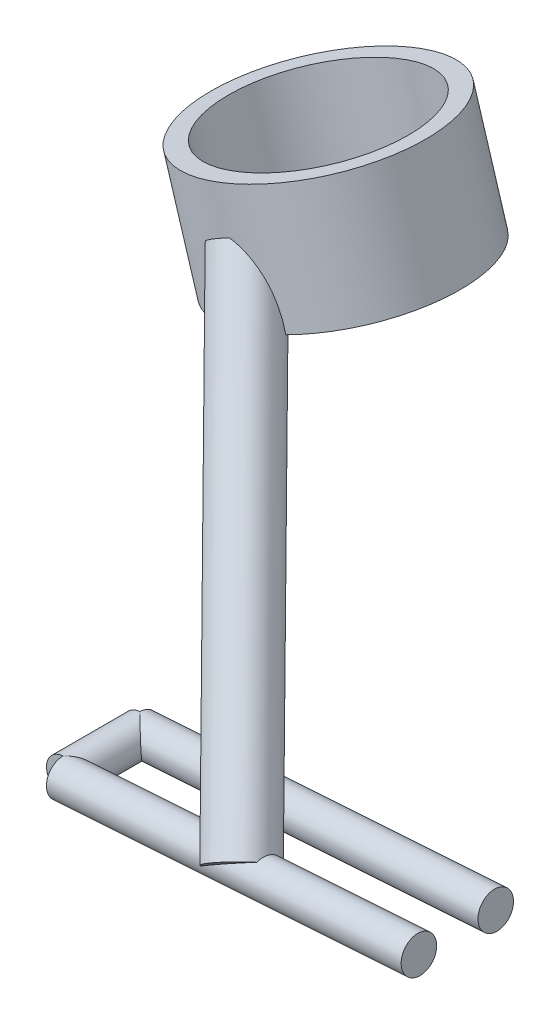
from build123d import *

# Parameters (mm, degrees)
ABRAZADERA_PROFILE_R         = 19
BRAZO_PROFILE_R              = 5
PLACA_INT_PROFILE_R          = 3
PLACA_EXT_PROFILE_R          = 3
PUENTE_PLACAS_PROFILE_R      = 3
TALADRO_ABRAZADERA_PROFILE_R = 15.9


with BuildPart() as part:
    # Abrazadera: sweep along a curve in space
    with BuildLine() as abrazadera_path:
        Line((-51.165048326, 167.353332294, 0), (-57.012482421, 186.479427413, 0))
    # Abrazadera profile (on start of the path) → Abrazadera (sweep)
    with BuildSketch(Plane(origin=(-51.165048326, 167.353332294, 0), x_dir=(0.9563047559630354, 0.29237170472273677, 0), z_dir=(-0.29237170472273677, 0.9563047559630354, 0))):
        Circle(ABRAZADERA_PROFILE_R)
    sweep(path=abrazadera_path.line)

    # Brazo: sweep along a curve in space
    with BuildLine() as brazo_path:
        Line((-54.088765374, 176.916379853, 15), (-20, 120, 50))
    # Brazo profile (on start of the path) → Brazo (sweep)
    with BuildSketch(Plane(origin=(-54.088765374, 176.916379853, 15), x_dir=(0, -0.523820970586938, -0.851828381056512), z_dir=(0.45445554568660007, -0.7587826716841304, 0.4666037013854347))):
        Circle(BRAZO_PROFILE_R)
    sweep(path=brazo_path.line)

    # Placa_ext: sweep along a curve in space
    with BuildLine() as placa_ext_path:
        Line((-50, 118, 50), (10, 122, 50))
    # Placa_ext profile (on start of the path) → Placa_ext (sweep)
    with BuildSketch(Plane(origin=(-50, 118, 50), x_dir=(-0.06651901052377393, 0.9977851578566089, 0), z_dir=(0.9977851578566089, 0.06651901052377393, 0))):
        Circle(PLACA_EXT_PROFILE_R)
    sweep(path=placa_ext_path.line)



with BuildPart() as body_2:
    # Placa_int: sweep along a curve in space
    with BuildLine() as placa_int_path:
        Line((-50, 118, 37), (10, 122, 37))
    # Placa_int profile (on start of the path) → Placa_int (sweep)
    with BuildSketch(Plane(origin=(-50, 118, 37), x_dir=(-0.06651901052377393, 0.9977851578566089, 0), z_dir=(0.9977851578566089, 0.06651901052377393, 0))):
        Circle(PLACA_INT_PROFILE_R)
    sweep(path=placa_int_path.line)


with BuildPart() as part_1:
    add(part.part)

    add(body_2.part)  # Puente_placas merges body 2
    # Puente_placas: sweep along a curve in space
    with BuildLine() as puente_placas_path:
        Line((-50, 118, 37), (-50, 118, 50))
    # Puente_placas profile (on start of the path) → Puente_placas (sweep)
    with BuildSketch(Plane(origin=(-50, 118, 37), x_dir=(1, 0, 0), z_dir=(0, 0, 1))):
        Circle(PUENTE_PLACAS_PROFILE_R)
    sweep(path=puente_placas_path.line)

    # Taladro_abrazadera: sweep along a curve in space
    with BuildLine() as taladro_abrazadera_path:
        Line((-49.703189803, 162.571808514, 0), (-58.474340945, 191.260951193, 0))
    # Taladro_abrazadera profile (on start of the path) → Taladro_abrazadera (sweep, cut)
    with BuildSketch(Plane(origin=(-49.703189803, 162.571808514, 0), x_dir=(0.9563047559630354, 0.2923717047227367, 0), z_dir=(-0.2923717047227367, 0.9563047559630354, 0))):
        Circle(TALADRO_ABRAZADERA_PROFILE_R)
    sweep(path=taladro_abrazadera_path.line, mode=Mode.SUBTRACT)


solid = part_1.part
